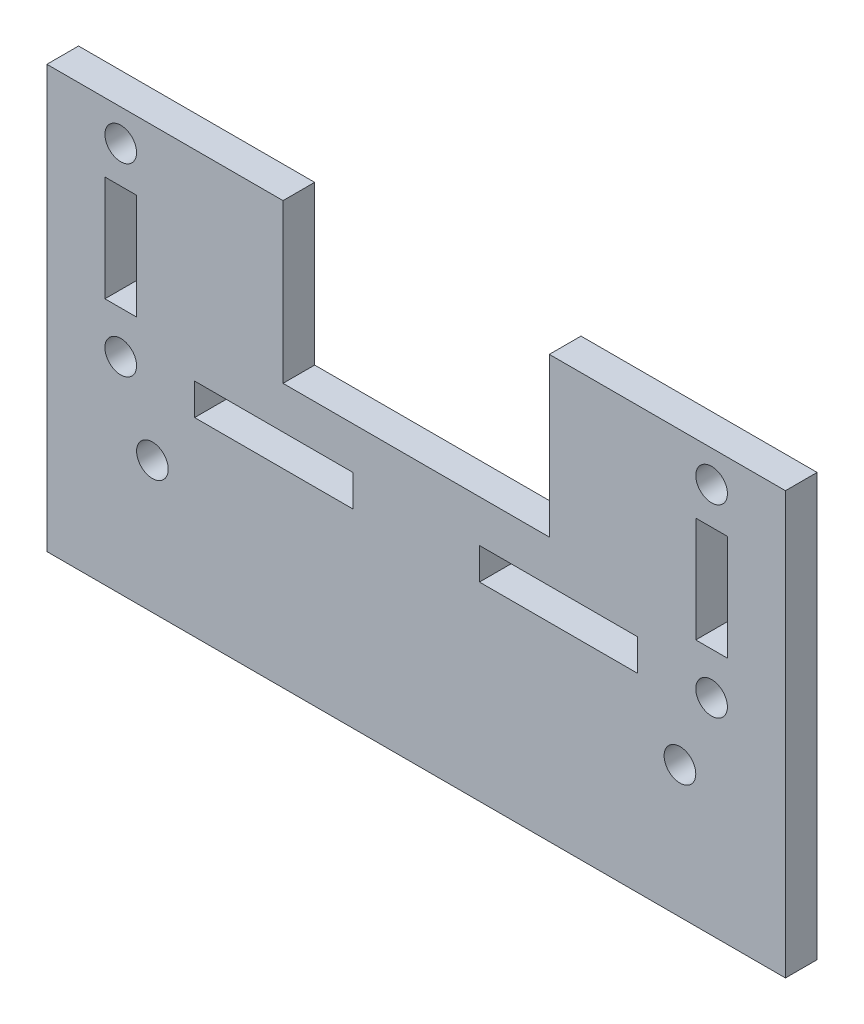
from build123d import *

# Parameters (mm, degrees)
SKETCH1_W           = 22.379614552
SKETCH1_H           = 15
SKETCH1_W_2         = 70
SKETCH1_H_2         = 25
SKETCH1_R           = 1.5
SKETCH1_R_2         = 4.7625
BOSS_EXTRUDE1_DEPTH = 3
SKETCH3_W           = 3
SKETCH3_H           = 10
SKETCH3_R           = 1.5
SKETCH3_W_2         = 15
SKETCH3_H_2         = 3
CUT_EXTRUDE1_DEPTH  = 10


with BuildPart() as part:
    # Sketch1 → Boss-Extrude1 (new body)
    # profile 1 of 4: a face of its own
    with BuildSketch(Plane.XY):
        with Locations((-23.810192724, 20)):
            Rectangle(SKETCH1_W, SKETCH1_H)
    # profile 2 of 4: a face of its own
    with BuildSketch(Plane.XY):
        with Locations((23.810192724, 20)):
            Rectangle(SKETCH1_W, SKETCH1_H)
    # profile 3 of 4: a face of its own
    with BuildSketch(Plane.XY):
        Rectangle(SKETCH1_W_2, SKETCH1_H_2)
        with Locations((25, 0)):
            Circle(SKETCH1_R, mode=Mode.SUBTRACT)
        with Locations((-25, 0)):
            Circle(SKETCH1_R, mode=Mode.SUBTRACT)
        Circle(SKETCH1_R_2, mode=Mode.SUBTRACT)
    # profile 4 of 4: a face of its own
    with BuildSketch(Plane.XY):
        Circle(SKETCH1_R_2)
    extrude(amount=BOSS_EXTRUDE1_DEPTH)

    # Sketch3 → Cut-Extrude1 (cut)
    with BuildSketch(Plane.XY.offset(3)):
        with Locations((-28, 16)):
            Rectangle(SKETCH3_W, SKETCH3_H)
        with Locations((-28, 24.5)):
            Circle(SKETCH3_R)
        with Locations((-28, 7)):
            Circle(SKETCH3_R)
        with Locations((-13.5, 7)):
            Rectangle(SKETCH3_W_2, SKETCH3_H_2)
        with Locations((13.5, 7)):
            Rectangle(SKETCH3_W_2, SKETCH3_H_2)
        with Locations((28, 16)):
            Rectangle(SKETCH3_W, SKETCH3_H)
        with Locations((28, 24.5)):
            Circle(SKETCH3_R)
        with Locations((28, 7)):
            Circle(SKETCH3_R)
    extrude(amount=-CUT_EXTRUDE1_DEPTH, mode=Mode.SUBTRACT)


solid = part.part
